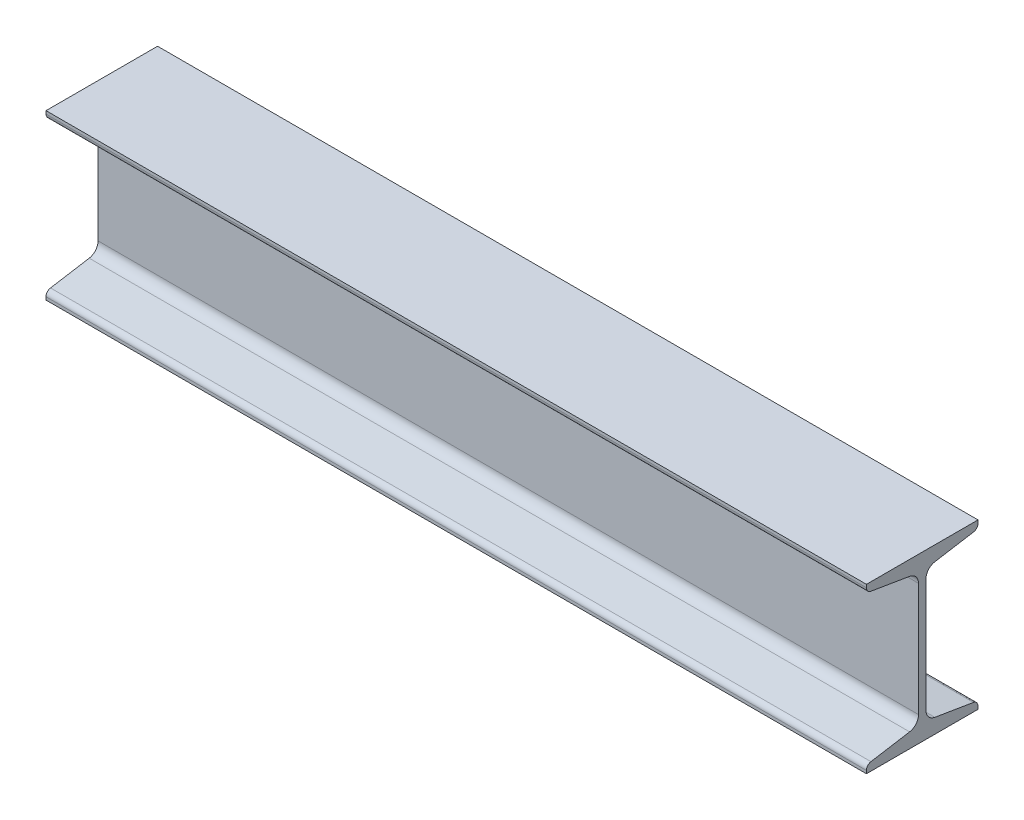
ISO-10303-21;
HEADER;
FILE_DESCRIPTION(('STEP AP214'),'2;1');
FILE_NAME('part.step','',(''),(''),'','','');
FILE_SCHEMA(('AUTOMOTIVE_DESIGN { 1 0 10303 214 1 1 1 1 }'));
ENDSEC;
DATA;
#1=APPLICATION_CONTEXT('core data for automotive mechanical design processes');
#2=APPLICATION_PROTOCOL_DEFINITION('international standard','automotive_design',2000,#1);
#3=PRODUCT_CONTEXT('',#1,'mechanical');
#4=PRODUCT('Part','Part','',(#3));
#5=PRODUCT_RELATED_PRODUCT_CATEGORY('part','',(#4));
#6=PRODUCT_DEFINITION_FORMATION('','',#4);
#7=PRODUCT_DEFINITION_CONTEXT('part definition',#1,'design');
#8=PRODUCT_DEFINITION('design','',#6,#7);
#9=PRODUCT_DEFINITION_SHAPE('','',#8);
#10=(LENGTH_UNIT() NAMED_UNIT(*) SI_UNIT(.MILLI.,.METRE.));
#11=(NAMED_UNIT(*) PLANE_ANGLE_UNIT() SI_UNIT($,.RADIAN.));
#12=(NAMED_UNIT(*) SI_UNIT($,.STERADIAN.) SOLID_ANGLE_UNIT());
#13=UNCERTAINTY_MEASURE_WITH_UNIT(LENGTH_MEASURE(1.E-05),#10,'distance_accuracy_value','');
#14=(GEOMETRIC_REPRESENTATION_CONTEXT(3) GLOBAL_UNCERTAINTY_ASSIGNED_CONTEXT((#13)) GLOBAL_UNIT_ASSIGNED_CONTEXT((#10,
#11,#12)) REPRESENTATION_CONTEXT('',''));
#15=CARTESIAN_POINT('',(0.,0.,0.));
#16=DIRECTION('',(0.,0.,1.));
#17=DIRECTION('',(1.,0.,0.));
#18=AXIS2_PLACEMENT_3D('',#15,#16,#17);
#19=CARTESIAN_POINT('',(500.,4.57916666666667,34.));
#20=DIRECTION('',(0.,0.,-1.));
#21=DIRECTION('',(-1.,0.,0.));
#22=AXIS2_PLACEMENT_3D('',#19,#20,#21);
#23=PLANE('',#22);
#24=DIRECTION('',(0.,-1.,0.));
#25=VECTOR('',#24,1.);
#26=CARTESIAN_POINT('',(500.,4.57916666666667,34.));
#27=LINE('',#26,#25);
#28=CARTESIAN_POINT('',(500.,1.78364727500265,34.));
#29=VERTEX_POINT('',#28);
#30=CARTESIAN_POINT('',(500.,0.,34.));
#31=VERTEX_POINT('',#30);
#32=EDGE_CURVE('E170',#29,#31,#27,.T.);
#33=ORIENTED_EDGE('',*,*,#32,.F.);
#34=DIRECTION('',(-1.,0.,0.));
#35=VECTOR('',#34,1.);
#36=CARTESIAN_POINT('',(500.,1.78364727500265,34.));
#37=LINE('',#36,#35);
#38=CARTESIAN_POINT('',(0.,1.78364727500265,34.));
#39=VERTEX_POINT('',#38);
#40=EDGE_CURVE('E261',#29,#39,#37,.T.);
#41=ORIENTED_EDGE('',*,*,#40,.T.);
#42=DIRECTION('',(0.,-1.,0.));
#43=VECTOR('',#42,1.);
#44=CARTESIAN_POINT('',(0.,4.57916666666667,34.));
#45=LINE('',#44,#43);
#46=CARTESIAN_POINT('',(0.,0.,34.));
#47=VERTEX_POINT('',#46);
#48=EDGE_CURVE('E195',#39,#47,#45,.T.);
#49=ORIENTED_EDGE('',*,*,#48,.T.);
#50=DIRECTION('',(-1.,0.,0.));
#51=VECTOR('',#50,1.);
#52=CARTESIAN_POINT('',(500.,0.,34.));
#53=LINE('',#52,#51);
#54=EDGE_CURVE('E188',#31,#47,#53,.T.);
#55=ORIENTED_EDGE('',*,*,#54,.F.);
#56=EDGE_LOOP('',(#33,#41,#49,#55));
#57=FACE_BOUND('',#56,.T.);
#58=ADVANCED_FACE('F33',(#57),#23,.F.);
#59=CARTESIAN_POINT('',(500.,0.,34.));
#60=DIRECTION('',(0.,1.,0.));
#61=DIRECTION('',(0.,0.,1.));
#62=AXIS2_PLACEMENT_3D('',#59,#60,#61);
#63=PLANE('',#62);
#64=DIRECTION('',(0.,0.,-1.));
#65=VECTOR('',#64,1.);
#66=CARTESIAN_POINT('',(0.,0.,34.));
#67=LINE('',#66,#65);
#68=CARTESIAN_POINT('',(0.,0.,-34.));
#69=VERTEX_POINT('',#68);
#70=EDGE_CURVE('E325',#47,#69,#67,.T.);
#71=ORIENTED_EDGE('',*,*,#70,.T.);
#72=DIRECTION('',(-1.,0.,0.));
#73=VECTOR('',#72,1.);
#74=CARTESIAN_POINT('',(500.,0.,-34.));
#75=LINE('',#74,#73);
#76=CARTESIAN_POINT('',(500.,0.,-34.));
#77=VERTEX_POINT('',#76);
#78=EDGE_CURVE('E190',#77,#69,#75,.T.);
#79=ORIENTED_EDGE('',*,*,#78,.F.);
#80=DIRECTION('',(0.,0.,-1.));
#81=VECTOR('',#80,1.);
#82=CARTESIAN_POINT('',(500.,0.,34.));
#83=LINE('',#82,#81);
#84=EDGE_CURVE('E175',#31,#77,#83,.T.);
#85=ORIENTED_EDGE('',*,*,#84,.F.);
#86=ORIENTED_EDGE('',*,*,#54,.T.);
#87=EDGE_LOOP('',(#71,#79,#85,#86));
#88=FACE_BOUND('',#87,.T.);
#89=ADVANCED_FACE('F187',(#88),#63,.F.);
#90=CARTESIAN_POINT('',(500.,4.57916666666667,-34.));
#91=DIRECTION('',(0.,0.,1.));
#92=DIRECTION('',(0.,-1.,0.));
#93=AXIS2_PLACEMENT_3D('',#90,#91,#92);
#94=PLANE('',#93);
#95=DIRECTION('',(0.,1.,0.));
#96=VECTOR('',#95,1.);
#97=CARTESIAN_POINT('',(0.,4.57916666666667,-34.));
#98=LINE('',#97,#96);
#99=CARTESIAN_POINT('',(0.,1.78364727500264,-34.));
#100=VERTEX_POINT('',#99);
#101=EDGE_CURVE('E327',#69,#100,#98,.T.);
#102=ORIENTED_EDGE('',*,*,#101,.T.);
#103=DIRECTION('',(-1.,0.,0.));
#104=VECTOR('',#103,1.);
#105=CARTESIAN_POINT('',(500.,1.78364727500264,-34.));
#106=LINE('',#105,#104);
#107=CARTESIAN_POINT('',(500.,1.78364727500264,-34.));
#108=VERTEX_POINT('',#107);
#109=EDGE_CURVE('E267',#100,#108,#106,.F.);
#110=ORIENTED_EDGE('',*,*,#109,.T.);
#111=DIRECTION('',(0.,1.,0.));
#112=VECTOR('',#111,1.);
#113=CARTESIAN_POINT('',(500.,4.57916666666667,-34.));
#114=LINE('',#113,#112);
#115=EDGE_CURVE('E192',#77,#108,#114,.T.);
#116=ORIENTED_EDGE('',*,*,#115,.F.);
#117=ORIENTED_EDGE('',*,*,#78,.T.);
#118=EDGE_LOOP('',(#102,#110,#116,#117));
#119=FACE_BOUND('',#118,.T.);
#120=ADVANCED_FACE('F383',(#119),#94,.F.);
#121=CARTESIAN_POINT('',(500.,9.87083333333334,-2.25000000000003));
#122=DIRECTION('',(0.,-0.986393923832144,0.164398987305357));
#123=DIRECTION('',(0.,-0.164398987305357,-0.986393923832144));
#124=AXIS2_PLACEMENT_3D('',#121,#122,#123);
#125=PLANE('',#124);
#126=DIRECTION('',(0.,0.164398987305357,0.986393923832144));
#127=VECTOR('',#126,1.);
#128=CARTESIAN_POINT('',(500.,9.87083333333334,-2.25000000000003));
#129=LINE('',#128,#127);
#130=CARTESIAN_POINT('',(500.,5.03874722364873,-31.2425166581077));
#131=VERTEX_POINT('',#130);
#132=CARTESIAN_POINT('',(500.,8.96559890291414,-7.68140658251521));
#133=VERTEX_POINT('',#132);
#134=EDGE_CURVE('E348',#131,#133,#129,.T.);
#135=ORIENTED_EDGE('',*,*,#134,.F.);
#136=DIRECTION('',(-1.,0.,0.));
#137=VECTOR('',#136,1.);
#138=CARTESIAN_POINT('',(500.,5.03874722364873,-31.2425166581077));
#139=LINE('',#138,#137);
#140=CARTESIAN_POINT('',(0.,5.03874722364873,-31.2425166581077));
#141=VERTEX_POINT('',#140);
#142=EDGE_CURVE('E264',#131,#141,#139,.T.);
#143=ORIENTED_EDGE('',*,*,#142,.T.);
#144=DIRECTION('',(0.,0.164398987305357,0.986393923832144));
#145=VECTOR('',#144,1.);
#146=CARTESIAN_POINT('',(0.,9.87083333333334,-2.25000000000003));
#147=LINE('',#146,#145);
#148=CARTESIAN_POINT('',(0.,8.96559890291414,-7.68140658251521));
#149=VERTEX_POINT('',#148);
#150=EDGE_CURVE('E330',#141,#149,#147,.T.);
#151=ORIENTED_EDGE('',*,*,#150,.T.);
#152=DIRECTION('',(-1.,0.,0.));
#153=VECTOR('',#152,1.);
#154=CARTESIAN_POINT('',(500.,8.96559890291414,-7.68140658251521));
#155=LINE('',#154,#153);
#156=EDGE_CURVE('E210',#149,#133,#155,.F.);
#157=ORIENTED_EDGE('',*,*,#156,.T.);
#158=EDGE_LOOP('',(#135,#143,#151,#157));
#159=FACE_BOUND('',#158,.T.);
#160=ADVANCED_FACE('F361',(#159),#125,.F.);
#161=CARTESIAN_POINT('',(500.,90.1291666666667,-2.25000000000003));
#162=DIRECTION('',(0.,0.,1.));
#163=DIRECTION('',(0.,-1.,0.));
#164=AXIS2_PLACEMENT_3D('',#161,#162,#163);
#165=PLANE('',#164);
#166=DIRECTION('',(0.,1.,0.));
#167=VECTOR('',#166,1.);
#168=CARTESIAN_POINT('',(0.,90.1291666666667,-2.25000000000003));
#169=LINE('',#168,#167);
#170=CARTESIAN_POINT('',(0.,15.3771594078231,-2.25000000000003));
#171=VERTEX_POINT('',#170);
#172=CARTESIAN_POINT('',(0.,84.622840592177,-2.25000000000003));
#173=VERTEX_POINT('',#172);
#174=EDGE_CURVE('E290',#171,#173,#169,.T.);
#175=ORIENTED_EDGE('',*,*,#174,.T.);
#176=DIRECTION('',(-1.,0.,0.));
#177=VECTOR('',#176,1.);
#178=CARTESIAN_POINT('',(500.,84.622840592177,-2.25000000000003));
#179=LINE('',#178,#177);
#180=CARTESIAN_POINT('',(500.,84.622840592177,-2.25000000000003));
#181=VERTEX_POINT('',#180);
#182=EDGE_CURVE('E208',#173,#181,#179,.F.);
#183=ORIENTED_EDGE('',*,*,#182,.T.);
#184=DIRECTION('',(0.,1.,0.));
#185=VECTOR('',#184,1.);
#186=CARTESIAN_POINT('',(500.,90.1291666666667,-2.25000000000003));
#187=LINE('',#186,#185);
#188=CARTESIAN_POINT('',(500.,15.3771594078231,-2.25000000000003));
#189=VERTEX_POINT('',#188);
#190=EDGE_CURVE('E344',#189,#181,#187,.T.);
#191=ORIENTED_EDGE('',*,*,#190,.F.);
#192=DIRECTION('',(-1.,0.,0.));
#193=VECTOR('',#192,1.);
#194=CARTESIAN_POINT('',(0.,15.3771594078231,-2.25000000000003));
#195=LINE('',#194,#193);
#196=EDGE_CURVE('E200',#189,#171,#195,.T.);
#197=ORIENTED_EDGE('',*,*,#196,.T.);
#198=EDGE_LOOP('',(#175,#183,#191,#197));
#199=FACE_BOUND('',#198,.T.);
#200=ADVANCED_FACE('F335',(#199),#165,.F.);
#201=CARTESIAN_POINT('',(500.,95.4208333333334,-34.));
#202=DIRECTION('',(0.,0.986393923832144,0.164398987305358));
#203=DIRECTION('',(0.,-0.164398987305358,0.986393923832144));
#204=AXIS2_PLACEMENT_3D('',#201,#202,#203);
#205=PLANE('',#204);
#206=DIRECTION('',(0.,0.164398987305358,-0.986393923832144));
#207=VECTOR('',#206,1.);
#208=CARTESIAN_POINT('',(0.,95.4208333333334,-34.));
#209=LINE('',#208,#207);
#210=CARTESIAN_POINT('',(0.,91.0344010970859,-7.6814065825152));
#211=VERTEX_POINT('',#210);
#212=CARTESIAN_POINT('',(0.,94.9612527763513,-31.2425166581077));
#213=VERTEX_POINT('',#212);
#214=EDGE_CURVE('E286',#211,#213,#209,.T.);
#215=ORIENTED_EDGE('',*,*,#214,.T.);
#216=DIRECTION('',(-1.,0.,0.));
#217=VECTOR('',#216,1.);
#218=CARTESIAN_POINT('',(500.,94.9612527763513,-31.2425166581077));
#219=LINE('',#218,#217);
#220=CARTESIAN_POINT('',(500.,94.9612527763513,-31.2425166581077));
#221=VERTEX_POINT('',#220);
#222=EDGE_CURVE('E11',#213,#221,#219,.F.);
#223=ORIENTED_EDGE('',*,*,#222,.T.);
#224=DIRECTION('',(0.,0.164398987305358,-0.986393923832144));
#225=VECTOR('',#224,1.);
#226=CARTESIAN_POINT('',(500.,95.4208333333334,-34.));
#227=LINE('',#226,#225);
#228=CARTESIAN_POINT('',(500.,91.0344010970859,-7.6814065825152));
#229=VERTEX_POINT('',#228);
#230=EDGE_CURVE('E315',#229,#221,#227,.T.);
#231=ORIENTED_EDGE('',*,*,#230,.F.);
#232=DIRECTION('',(-1.,0.,0.));
#233=VECTOR('',#232,1.);
#234=CARTESIAN_POINT('',(0.,91.0344010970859,-7.6814065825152));
#235=LINE('',#234,#233);
#236=EDGE_CURVE('E197',#229,#211,#235,.T.);
#237=ORIENTED_EDGE('',*,*,#236,.T.);
#238=EDGE_LOOP('',(#215,#223,#231,#237));
#239=FACE_BOUND('',#238,.T.);
#240=ADVANCED_FACE('F346',(#239),#205,.F.);
#241=CARTESIAN_POINT('',(500.,100.,-34.));
#242=DIRECTION('',(0.,0.,1.));
#243=DIRECTION('',(0.,-1.,0.));
#244=AXIS2_PLACEMENT_3D('',#241,#242,#243);
#245=PLANE('',#244);
#246=DIRECTION('',(0.,1.,0.));
#247=VECTOR('',#246,1.);
#248=CARTESIAN_POINT('',(500.,100.,-34.));
#249=LINE('',#248,#247);
#250=CARTESIAN_POINT('',(500.,98.2163527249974,-34.));
#251=VERTEX_POINT('',#250);
#252=CARTESIAN_POINT('',(500.,100.,-34.));
#253=VERTEX_POINT('',#252);
#254=EDGE_CURVE('E276',#251,#253,#249,.T.);
#255=ORIENTED_EDGE('',*,*,#254,.F.);
#256=DIRECTION('',(-1.,0.,0.));
#257=VECTOR('',#256,1.);
#258=CARTESIAN_POINT('',(500.,98.2163527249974,-34.));
#259=LINE('',#258,#257);
#260=CARTESIAN_POINT('',(0.,98.2163527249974,-34.));
#261=VERTEX_POINT('',#260);
#262=EDGE_CURVE('E41',#251,#261,#259,.T.);
#263=ORIENTED_EDGE('',*,*,#262,.T.);
#264=DIRECTION('',(0.,1.,0.));
#265=VECTOR('',#264,1.);
#266=CARTESIAN_POINT('',(0.,100.,-34.));
#267=LINE('',#266,#265);
#268=CARTESIAN_POINT('',(0.,100.,-34.));
#269=VERTEX_POINT('',#268);
#270=EDGE_CURVE('E274',#261,#269,#267,.T.);
#271=ORIENTED_EDGE('',*,*,#270,.T.);
#272=DIRECTION('',(-1.,0.,0.));
#273=VECTOR('',#272,1.);
#274=CARTESIAN_POINT('',(500.,100.,-34.));
#275=LINE('',#274,#273);
#276=EDGE_CURVE('E202',#253,#269,#275,.T.);
#277=ORIENTED_EDGE('',*,*,#276,.F.);
#278=EDGE_LOOP('',(#255,#263,#271,#277));
#279=FACE_BOUND('',#278,.T.);
#280=ADVANCED_FACE('F272',(#279),#245,.F.);
#281=CARTESIAN_POINT('',(500.,100.,34.));
#282=DIRECTION('',(0.,-1.,0.));
#283=DIRECTION('',(0.,0.,-1.));
#284=AXIS2_PLACEMENT_3D('',#281,#282,#283);
#285=PLANE('',#284);
#286=DIRECTION('',(0.,0.,1.));
#287=VECTOR('',#286,1.);
#288=CARTESIAN_POINT('',(0.,100.,34.));
#289=LINE('',#288,#287);
#290=CARTESIAN_POINT('',(0.,100.,34.));
#291=VERTEX_POINT('',#290);
#292=EDGE_CURVE('E285',#269,#291,#289,.T.);
#293=ORIENTED_EDGE('',*,*,#292,.T.);
#294=DIRECTION('',(-1.,0.,0.));
#295=VECTOR('',#294,1.);
#296=CARTESIAN_POINT('',(500.,100.,34.));
#297=LINE('',#296,#295);
#298=CARTESIAN_POINT('',(500.,100.,34.));
#299=VERTEX_POINT('',#298);
#300=EDGE_CURVE('E302',#299,#291,#297,.T.);
#301=ORIENTED_EDGE('',*,*,#300,.F.);
#302=DIRECTION('',(0.,0.,1.));
#303=VECTOR('',#302,1.);
#304=CARTESIAN_POINT('',(500.,100.,34.));
#305=LINE('',#304,#303);
#306=EDGE_CURVE('E309',#253,#299,#305,.T.);
#307=ORIENTED_EDGE('',*,*,#306,.F.);
#308=ORIENTED_EDGE('',*,*,#276,.T.);
#309=EDGE_LOOP('',(#293,#301,#307,#308));
#310=FACE_BOUND('',#309,.T.);
#311=ADVANCED_FACE('F307',(#310),#285,.F.);
#312=CARTESIAN_POINT('',(500.,100.,34.));
#313=DIRECTION('',(0.,0.,-1.));
#314=DIRECTION('',(0.,1.,0.));
#315=AXIS2_PLACEMENT_3D('',#312,#313,#314);
#316=PLANE('',#315);
#317=DIRECTION('',(0.,-1.,0.));
#318=VECTOR('',#317,1.);
#319=CARTESIAN_POINT('',(0.,100.,34.));
#320=LINE('',#319,#318);
#321=CARTESIAN_POINT('',(0.,98.2163527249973,34.));
#322=VERTEX_POINT('',#321);
#323=EDGE_CURVE('E288',#291,#322,#320,.T.);
#324=ORIENTED_EDGE('',*,*,#323,.T.);
#325=DIRECTION('',(-1.,0.,0.));
#326=VECTOR('',#325,1.);
#327=CARTESIAN_POINT('',(500.,98.2163527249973,34.));
#328=LINE('',#327,#326);
#329=CARTESIAN_POINT('',(500.,98.2163527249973,34.));
#330=VERTEX_POINT('',#329);
#331=EDGE_CURVE('E253',#322,#330,#328,.F.);
#332=ORIENTED_EDGE('',*,*,#331,.T.);
#333=DIRECTION('',(0.,-1.,0.));
#334=VECTOR('',#333,1.);
#335=CARTESIAN_POINT('',(500.,100.,34.));
#336=LINE('',#335,#334);
#337=EDGE_CURVE('E311',#299,#330,#336,.T.);
#338=ORIENTED_EDGE('',*,*,#337,.F.);
#339=ORIENTED_EDGE('',*,*,#300,.T.);
#340=EDGE_LOOP('',(#324,#332,#338,#339));
#341=FACE_BOUND('',#340,.T.);
#342=ADVANCED_FACE('F398',(#341),#316,.F.);
#343=CARTESIAN_POINT('',(500.,95.4208333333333,34.));
#344=DIRECTION('',(0.,0.986393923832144,-0.164398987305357));
#345=DIRECTION('',(0.,0.164398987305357,0.986393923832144));
#346=AXIS2_PLACEMENT_3D('',#343,#344,#345);
#347=PLANE('',#346);
#348=DIRECTION('',(0.,-0.164398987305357,-0.986393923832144));
#349=VECTOR('',#348,1.);
#350=CARTESIAN_POINT('',(500.,95.4208333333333,34.));
#351=LINE('',#350,#349);
#352=CARTESIAN_POINT('',(500.,94.9612527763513,31.2425166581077));
#353=VERTEX_POINT('',#352);
#354=CARTESIAN_POINT('',(500.,91.0344010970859,7.6814065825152));
#355=VERTEX_POINT('',#354);
#356=EDGE_CURVE('E313',#353,#355,#351,.T.);
#357=ORIENTED_EDGE('',*,*,#356,.F.);
#358=DIRECTION('',(-1.,0.,0.));
#359=VECTOR('',#358,1.);
#360=CARTESIAN_POINT('',(500.,94.9612527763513,31.2425166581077));
#361=LINE('',#360,#359);
#362=CARTESIAN_POINT('',(0.,94.9612527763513,31.2425166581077));
#363=VERTEX_POINT('',#362);
#364=EDGE_CURVE('E242',#353,#363,#361,.T.);
#365=ORIENTED_EDGE('',*,*,#364,.T.);
#366=DIRECTION('',(0.,-0.164398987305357,-0.986393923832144));
#367=VECTOR('',#366,1.);
#368=CARTESIAN_POINT('',(0.,95.4208333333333,34.));
#369=LINE('',#368,#367);
#370=CARTESIAN_POINT('',(0.,91.0344010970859,7.6814065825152));
#371=VERTEX_POINT('',#370);
#372=EDGE_CURVE('E296',#363,#371,#369,.T.);
#373=ORIENTED_EDGE('',*,*,#372,.T.);
#374=DIRECTION('',(-1.,0.,0.));
#375=VECTOR('',#374,1.);
#376=CARTESIAN_POINT('',(500.,91.0344010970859,7.6814065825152));
#377=LINE('',#376,#375);
#378=EDGE_CURVE('E221',#371,#355,#377,.F.);
#379=ORIENTED_EDGE('',*,*,#378,.T.);
#380=EDGE_LOOP('',(#357,#365,#373,#379));
#381=FACE_BOUND('',#380,.T.);
#382=ADVANCED_FACE('F401',(#381),#347,.F.);
#383=CARTESIAN_POINT('',(500.,90.1291666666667,2.25000000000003));
#384=DIRECTION('',(0.,0.,-1.));
#385=DIRECTION('',(0.,1.,0.));
#386=AXIS2_PLACEMENT_3D('',#383,#384,#385);
#387=PLANE('',#386);
#388=DIRECTION('',(0.,-1.,0.));
#389=VECTOR('',#388,1.);
#390=CARTESIAN_POINT('',(0.,90.1291666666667,2.25000000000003));
#391=LINE('',#390,#389);
#392=CARTESIAN_POINT('',(0.,84.6228405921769,2.25000000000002));
#393=VERTEX_POINT('',#392);
#394=CARTESIAN_POINT('',(0.,15.3771594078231,2.25000000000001));
#395=VERTEX_POINT('',#394);
#396=EDGE_CURVE('E298',#393,#395,#391,.T.);
#397=ORIENTED_EDGE('',*,*,#396,.T.);
#398=DIRECTION('',(-1.,0.,0.));
#399=VECTOR('',#398,1.);
#400=CARTESIAN_POINT('',(500.,15.3771594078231,2.25000000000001));
#401=LINE('',#400,#399);
#402=CARTESIAN_POINT('',(500.,15.3771594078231,2.25000000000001));
#403=VERTEX_POINT('',#402);
#404=EDGE_CURVE('E219',#395,#403,#401,.F.);
#405=ORIENTED_EDGE('',*,*,#404,.T.);
#406=DIRECTION('',(0.,-1.,0.));
#407=VECTOR('',#406,1.);
#408=CARTESIAN_POINT('',(500.,90.1291666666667,2.25000000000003));
#409=LINE('',#408,#407);
#410=CARTESIAN_POINT('',(500.,84.6228405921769,2.25000000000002));
#411=VERTEX_POINT('',#410);
#412=EDGE_CURVE('E320',#411,#403,#409,.T.);
#413=ORIENTED_EDGE('',*,*,#412,.F.);
#414=DIRECTION('',(-1.,0.,0.));
#415=VECTOR('',#414,1.);
#416=CARTESIAN_POINT('',(0.,84.6228405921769,2.25000000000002));
#417=LINE('',#416,#415);
#418=EDGE_CURVE('E216',#411,#393,#417,.T.);
#419=ORIENTED_EDGE('',*,*,#418,.T.);
#420=EDGE_LOOP('',(#397,#405,#413,#419));
#421=FACE_BOUND('',#420,.T.);
#422=ADVANCED_FACE('F405',(#421),#387,.F.);
#423=CARTESIAN_POINT('',(500.,9.87083333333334,2.25));
#424=DIRECTION('',(0.,-0.986393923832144,-0.164398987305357));
#425=DIRECTION('',(0.,0.164398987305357,-0.986393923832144));
#426=AXIS2_PLACEMENT_3D('',#423,#424,#425);
#427=PLANE('',#426);
#428=DIRECTION('',(0.,-0.164398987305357,0.986393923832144));
#429=VECTOR('',#428,1.);
#430=CARTESIAN_POINT('',(0.,9.87083333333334,2.25));
#431=LINE('',#430,#429);
#432=CARTESIAN_POINT('',(0.,8.96559890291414,7.68140658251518));
#433=VERTEX_POINT('',#432);
#434=CARTESIAN_POINT('',(0.,5.03874722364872,31.2425166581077));
#435=VERTEX_POINT('',#434);
#436=EDGE_CURVE('E183',#433,#435,#431,.T.);
#437=ORIENTED_EDGE('',*,*,#436,.T.);
#438=DIRECTION('',(-1.,0.,0.));
#439=VECTOR('',#438,1.);
#440=CARTESIAN_POINT('',(500.,5.03874722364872,31.2425166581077));
#441=LINE('',#440,#439);
#442=CARTESIAN_POINT('',(500.,5.03874722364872,31.2425166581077));
#443=VERTEX_POINT('',#442);
#444=EDGE_CURVE('E48',#435,#443,#441,.F.);
#445=ORIENTED_EDGE('',*,*,#444,.T.);
#446=DIRECTION('',(0.,-0.164398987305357,0.986393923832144));
#447=VECTOR('',#446,1.);
#448=CARTESIAN_POINT('',(500.,9.87083333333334,2.25));
#449=LINE('',#448,#447);
#450=CARTESIAN_POINT('',(500.,8.96559890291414,7.68140658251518));
#451=VERTEX_POINT('',#450);
#452=EDGE_CURVE('E304',#451,#443,#449,.T.);
#453=ORIENTED_EDGE('',*,*,#452,.F.);
#454=DIRECTION('',(-1.,0.,0.));
#455=VECTOR('',#454,1.);
#456=CARTESIAN_POINT('',(0.,8.96559890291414,7.68140658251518));
#457=LINE('',#456,#455);
#458=EDGE_CURVE('E213',#451,#433,#457,.T.);
#459=ORIENTED_EDGE('',*,*,#458,.T.);
#460=EDGE_LOOP('',(#437,#445,#453,#459));
#461=FACE_BOUND('',#460,.T.);
#462=ADVANCED_FACE('F409',(#461),#427,.F.);
#463=CARTESIAN_POINT('',(500.,0.,34.));
#464=DIRECTION('',(1.,0.,0.));
#465=DIRECTION('',(0.,0.,-1.));
#466=AXIS2_PLACEMENT_3D('',#463,#464,#465);
#467=PLANE('',#466);
#468=ORIENTED_EDGE('',*,*,#337,.T.);
#469=CARTESIAN_POINT('',(500.,98.2163527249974,30.7));
#470=DIRECTION('',(1.,0.,0.));
#471=DIRECTION('',(0.,0.,-1.));
#472=AXIS2_PLACEMENT_3D('',#469,#470,#471);
#473=CIRCLE('',#472,3.3);
#474=EDGE_CURVE('E259',#330,#353,#473,.T.);
#475=ORIENTED_EDGE('',*,*,#474,.T.);
#476=ORIENTED_EDGE('',*,*,#356,.T.);
#477=CARTESIAN_POINT('',(500.,84.6228405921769,8.75000000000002));
#478=DIRECTION('',(1.,0.,0.));
#479=DIRECTION('',(0.,0.,-1.));
#480=AXIS2_PLACEMENT_3D('',#477,#478,#479);
#481=CIRCLE('',#480,6.5);
#482=EDGE_CURVE('E240',#355,#411,#481,.F.);
#483=ORIENTED_EDGE('',*,*,#482,.T.);
#484=ORIENTED_EDGE('',*,*,#412,.T.);
#485=CARTESIAN_POINT('',(500.,15.3771594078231,8.75000000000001));
#486=DIRECTION('',(1.,0.,0.));
#487=DIRECTION('',(0.,0.,-1.));
#488=AXIS2_PLACEMENT_3D('',#485,#486,#487);
#489=CIRCLE('',#488,6.5);
#490=EDGE_CURVE('E235',#403,#451,#489,.F.);
#491=ORIENTED_EDGE('',*,*,#490,.T.);
#492=ORIENTED_EDGE('',*,*,#452,.T.);
#493=CARTESIAN_POINT('',(500.,1.78364727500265,30.7));
#494=DIRECTION('',(1.,0.,0.));
#495=DIRECTION('',(0.,0.,-1.));
#496=AXIS2_PLACEMENT_3D('',#493,#494,#495);
#497=CIRCLE('',#496,3.3);
#498=EDGE_CURVE('E178',#443,#29,#497,.T.);
#499=ORIENTED_EDGE('',*,*,#498,.T.);
#500=ORIENTED_EDGE('',*,*,#32,.T.);
#501=ORIENTED_EDGE('',*,*,#84,.T.);
#502=ORIENTED_EDGE('',*,*,#115,.T.);
#503=CARTESIAN_POINT('',(500.,1.78364727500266,-30.7));
#504=DIRECTION('',(1.,0.,0.));
#505=DIRECTION('',(0.,0.,-1.));
#506=AXIS2_PLACEMENT_3D('',#503,#504,#505);
#507=CIRCLE('',#506,3.3);
#508=EDGE_CURVE('E256',#108,#131,#507,.T.);
#509=ORIENTED_EDGE('',*,*,#508,.T.);
#510=ORIENTED_EDGE('',*,*,#134,.T.);
#511=CARTESIAN_POINT('',(500.,15.3771594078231,-8.75000000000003));
#512=DIRECTION('',(1.,0.,0.));
#513=DIRECTION('',(0.,0.,-1.));
#514=AXIS2_PLACEMENT_3D('',#511,#512,#513);
#515=CIRCLE('',#514,6.5);
#516=EDGE_CURVE('E231',#133,#189,#515,.F.);
#517=ORIENTED_EDGE('',*,*,#516,.T.);
#518=ORIENTED_EDGE('',*,*,#190,.T.);
#519=CARTESIAN_POINT('',(500.,84.622840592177,-8.75000000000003));
#520=DIRECTION('',(1.,0.,0.));
#521=DIRECTION('',(0.,0.,-1.));
#522=AXIS2_PLACEMENT_3D('',#519,#520,#521);
#523=CIRCLE('',#522,6.5);
#524=EDGE_CURVE('E226',#181,#229,#523,.F.);
#525=ORIENTED_EDGE('',*,*,#524,.T.);
#526=ORIENTED_EDGE('',*,*,#230,.T.);
#527=CARTESIAN_POINT('',(500.,98.2163527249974,-30.7));
#528=DIRECTION('',(1.,0.,0.));
#529=DIRECTION('',(0.,0.,-1.));
#530=AXIS2_PLACEMENT_3D('',#527,#528,#529);
#531=CIRCLE('',#530,3.3);
#532=EDGE_CURVE('E56',#221,#251,#531,.T.);
#533=ORIENTED_EDGE('',*,*,#532,.T.);
#534=ORIENTED_EDGE('',*,*,#254,.T.);
#535=ORIENTED_EDGE('',*,*,#306,.T.);
#536=EDGE_LOOP('',(#468,#475,#476,#483,#484,#491,#492,#499,#500,#501,#502,#509,#510,#517,#518,
#525,#526,#533,#534,#535));
#537=FACE_BOUND('',#536,.T.);
#538=ADVANCED_FACE('F173',(#537),#467,.T.);
#539=CARTESIAN_POINT('',(0.,0.,34.));
#540=DIRECTION('',(1.,0.,0.));
#541=DIRECTION('',(0.,0.,-1.));
#542=AXIS2_PLACEMENT_3D('',#539,#540,#541);
#543=PLANE('',#542);
#544=ORIENTED_EDGE('',*,*,#372,.F.);
#545=CARTESIAN_POINT('',(0.,98.2163527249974,30.7));
#546=DIRECTION('',(1.,0.,0.));
#547=DIRECTION('',(0.,0.,-1.));
#548=AXIS2_PLACEMENT_3D('',#545,#546,#547);
#549=CIRCLE('',#548,3.3);
#550=EDGE_CURVE('E251',#363,#322,#549,.F.);
#551=ORIENTED_EDGE('',*,*,#550,.T.);
#552=ORIENTED_EDGE('',*,*,#323,.F.);
#553=ORIENTED_EDGE('',*,*,#292,.F.);
#554=ORIENTED_EDGE('',*,*,#270,.F.);
#555=CARTESIAN_POINT('',(0.,98.2163527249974,-30.7));
#556=DIRECTION('',(1.,0.,0.));
#557=DIRECTION('',(0.,0.,-1.));
#558=AXIS2_PLACEMENT_3D('',#555,#556,#557);
#559=CIRCLE('',#558,3.3);
#560=EDGE_CURVE('E245',#261,#213,#559,.F.);
#561=ORIENTED_EDGE('',*,*,#560,.T.);
#562=ORIENTED_EDGE('',*,*,#214,.F.);
#563=CARTESIAN_POINT('',(0.,84.622840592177,-8.75000000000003));
#564=DIRECTION('',(1.,0.,0.));
#565=DIRECTION('',(0.,0.,-1.));
#566=AXIS2_PLACEMENT_3D('',#563,#564,#565);
#567=CIRCLE('',#566,6.5);
#568=EDGE_CURVE('E224',#211,#173,#567,.T.);
#569=ORIENTED_EDGE('',*,*,#568,.T.);
#570=ORIENTED_EDGE('',*,*,#174,.F.);
#571=CARTESIAN_POINT('',(0.,15.3771594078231,-8.75000000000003));
#572=DIRECTION('',(1.,0.,0.));
#573=DIRECTION('',(0.,0.,-1.));
#574=AXIS2_PLACEMENT_3D('',#571,#572,#573);
#575=CIRCLE('',#574,6.5);
#576=EDGE_CURVE('E228',#171,#149,#575,.T.);
#577=ORIENTED_EDGE('',*,*,#576,.T.);
#578=ORIENTED_EDGE('',*,*,#150,.F.);
#579=CARTESIAN_POINT('',(0.,1.78364727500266,-30.7));
#580=DIRECTION('',(1.,0.,0.));
#581=DIRECTION('',(0.,0.,-1.));
#582=AXIS2_PLACEMENT_3D('',#579,#580,#581);
#583=CIRCLE('',#582,3.3);
#584=EDGE_CURVE('E247',#141,#100,#583,.F.);
#585=ORIENTED_EDGE('',*,*,#584,.T.);
#586=ORIENTED_EDGE('',*,*,#101,.F.);
#587=ORIENTED_EDGE('',*,*,#70,.F.);
#588=ORIENTED_EDGE('',*,*,#48,.F.);
#589=CARTESIAN_POINT('',(0.,1.78364727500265,30.7));
#590=DIRECTION('',(1.,0.,0.));
#591=DIRECTION('',(0.,0.,-1.));
#592=AXIS2_PLACEMENT_3D('',#589,#590,#591);
#593=CIRCLE('',#592,3.3);
#594=EDGE_CURVE('E249',#39,#435,#593,.F.);
#595=ORIENTED_EDGE('',*,*,#594,.T.);
#596=ORIENTED_EDGE('',*,*,#436,.F.);
#597=CARTESIAN_POINT('',(0.,15.3771594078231,8.75000000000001));
#598=DIRECTION('',(1.,0.,0.));
#599=DIRECTION('',(0.,0.,-1.));
#600=AXIS2_PLACEMENT_3D('',#597,#598,#599);
#601=CIRCLE('',#600,6.5);
#602=EDGE_CURVE('E233',#433,#395,#601,.T.);
#603=ORIENTED_EDGE('',*,*,#602,.T.);
#604=ORIENTED_EDGE('',*,*,#396,.F.);
#605=CARTESIAN_POINT('',(0.,84.6228405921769,8.75000000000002));
#606=DIRECTION('',(1.,0.,0.));
#607=DIRECTION('',(0.,0.,-1.));
#608=AXIS2_PLACEMENT_3D('',#605,#606,#607);
#609=CIRCLE('',#608,6.5);
#610=EDGE_CURVE('E237',#393,#371,#609,.T.);
#611=ORIENTED_EDGE('',*,*,#610,.T.);
#612=EDGE_LOOP('',(#544,#551,#552,#553,#554,#561,#562,#569,#570,#577,#578,#585,#586,#587,#588,
#595,#596,#603,#604,#611));
#613=FACE_BOUND('',#612,.T.);
#614=ADVANCED_FACE('F281',(#613),#543,.F.);
#615=CARTESIAN_POINT('',(500.,84.622840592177,-8.75000000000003));
#616=DIRECTION('',(1.,0.,0.));
#617=DIRECTION('',(0.,0.,-1.));
#618=AXIS2_PLACEMENT_3D('',#615,#616,#617);
#619=CYLINDRICAL_SURFACE('',#618,6.5);
#620=ORIENTED_EDGE('',*,*,#524,.F.);
#621=ORIENTED_EDGE('',*,*,#182,.F.);
#622=ORIENTED_EDGE('',*,*,#568,.F.);
#623=ORIENTED_EDGE('',*,*,#236,.F.);
#624=EDGE_LOOP('',(#620,#621,#622,#623));
#625=FACE_BOUND('',#624,.T.);
#626=ADVANCED_FACE('F341',(#625),#619,.F.);
#627=CARTESIAN_POINT('',(500.,15.3771594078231,-8.75000000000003));
#628=DIRECTION('',(1.,0.,0.));
#629=DIRECTION('',(0.,0.,-1.));
#630=AXIS2_PLACEMENT_3D('',#627,#628,#629);
#631=CYLINDRICAL_SURFACE('',#630,6.5);
#632=ORIENTED_EDGE('',*,*,#516,.F.);
#633=ORIENTED_EDGE('',*,*,#156,.F.);
#634=ORIENTED_EDGE('',*,*,#576,.F.);
#635=ORIENTED_EDGE('',*,*,#196,.F.);
#636=EDGE_LOOP('',(#632,#633,#634,#635));
#637=FACE_BOUND('',#636,.T.);
#638=ADVANCED_FACE('F366',(#637),#631,.F.);
#639=CARTESIAN_POINT('',(500.,15.3771594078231,8.75000000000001));
#640=DIRECTION('',(1.,0.,0.));
#641=DIRECTION('',(0.,0.,-1.));
#642=AXIS2_PLACEMENT_3D('',#639,#640,#641);
#643=CYLINDRICAL_SURFACE('',#642,6.5);
#644=ORIENTED_EDGE('',*,*,#490,.F.);
#645=ORIENTED_EDGE('',*,*,#404,.F.);
#646=ORIENTED_EDGE('',*,*,#602,.F.);
#647=ORIENTED_EDGE('',*,*,#458,.F.);
#648=EDGE_LOOP('',(#644,#645,#646,#647));
#649=FACE_BOUND('',#648,.T.);
#650=ADVANCED_FACE('F368',(#649),#643,.F.);
#651=CARTESIAN_POINT('',(500.,84.6228405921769,8.75000000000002));
#652=DIRECTION('',(1.,0.,0.));
#653=DIRECTION('',(0.,0.,-1.));
#654=AXIS2_PLACEMENT_3D('',#651,#652,#653);
#655=CYLINDRICAL_SURFACE('',#654,6.5);
#656=ORIENTED_EDGE('',*,*,#482,.F.);
#657=ORIENTED_EDGE('',*,*,#378,.F.);
#658=ORIENTED_EDGE('',*,*,#610,.F.);
#659=ORIENTED_EDGE('',*,*,#418,.F.);
#660=EDGE_LOOP('',(#656,#657,#658,#659));
#661=FACE_BOUND('',#660,.T.);
#662=ADVANCED_FACE('F374',(#661),#655,.F.);
#663=CARTESIAN_POINT('',(500.,98.2163527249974,30.7));
#664=DIRECTION('',(-1.,0.,0.));
#665=DIRECTION('',(0.,0.,1.));
#666=AXIS2_PLACEMENT_3D('',#663,#664,#665);
#667=CYLINDRICAL_SURFACE('',#666,3.3);
#668=ORIENTED_EDGE('',*,*,#474,.F.);
#669=ORIENTED_EDGE('',*,*,#331,.F.);
#670=ORIENTED_EDGE('',*,*,#550,.F.);
#671=ORIENTED_EDGE('',*,*,#364,.F.);
#672=EDGE_LOOP('',(#668,#669,#670,#671));
#673=FACE_BOUND('',#672,.T.);
#674=ADVANCED_FACE('F451',(#673),#667,.T.);
#675=CARTESIAN_POINT('',(500.,1.78364727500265,30.7));
#676=DIRECTION('',(-1.,0.,0.));
#677=DIRECTION('',(0.,0.,1.));
#678=AXIS2_PLACEMENT_3D('',#675,#676,#677);
#679=CYLINDRICAL_SURFACE('',#678,3.3);
#680=ORIENTED_EDGE('',*,*,#498,.F.);
#681=ORIENTED_EDGE('',*,*,#444,.F.);
#682=ORIENTED_EDGE('',*,*,#594,.F.);
#683=ORIENTED_EDGE('',*,*,#40,.F.);
#684=EDGE_LOOP('',(#680,#681,#682,#683));
#685=FACE_BOUND('',#684,.T.);
#686=ADVANCED_FACE('F529',(#685),#679,.T.);
#687=CARTESIAN_POINT('',(500.,1.78364727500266,-30.7));
#688=DIRECTION('',(-1.,0.,0.));
#689=DIRECTION('',(0.,0.,1.));
#690=AXIS2_PLACEMENT_3D('',#687,#688,#689);
#691=CYLINDRICAL_SURFACE('',#690,3.3);
#692=ORIENTED_EDGE('',*,*,#508,.F.);
#693=ORIENTED_EDGE('',*,*,#109,.F.);
#694=ORIENTED_EDGE('',*,*,#584,.F.);
#695=ORIENTED_EDGE('',*,*,#142,.F.);
#696=EDGE_LOOP('',(#692,#693,#694,#695));
#697=FACE_BOUND('',#696,.T.);
#698=ADVANCED_FACE('F358',(#697),#691,.T.);
#699=CARTESIAN_POINT('',(500.,98.2163527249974,-30.7));
#700=DIRECTION('',(-1.,0.,0.));
#701=DIRECTION('',(0.,0.,1.));
#702=AXIS2_PLACEMENT_3D('',#699,#700,#701);
#703=CYLINDRICAL_SURFACE('',#702,3.3);
#704=ORIENTED_EDGE('',*,*,#532,.F.);
#705=ORIENTED_EDGE('',*,*,#222,.F.);
#706=ORIENTED_EDGE('',*,*,#560,.F.);
#707=ORIENTED_EDGE('',*,*,#262,.F.);
#708=EDGE_LOOP('',(#704,#705,#706,#707));
#709=FACE_BOUND('',#708,.T.);
#710=ADVANCED_FACE('F35',(#709),#703,.T.);
#711=CLOSED_SHELL('',(#58,#89,#120,#160,#200,#240,#280,#311,#342,#382,#422,#462,#538,#614,#626,
#638,#650,#662,#674,#686,#698,#710));
#712=MANIFOLD_SOLID_BREP('B2',#711);
#713=ADVANCED_BREP_SHAPE_REPRESENTATION('',(#18,#712),#14);
#714=SHAPE_DEFINITION_REPRESENTATION(#9,#713);
ENDSEC;
END-ISO-10303-21;
